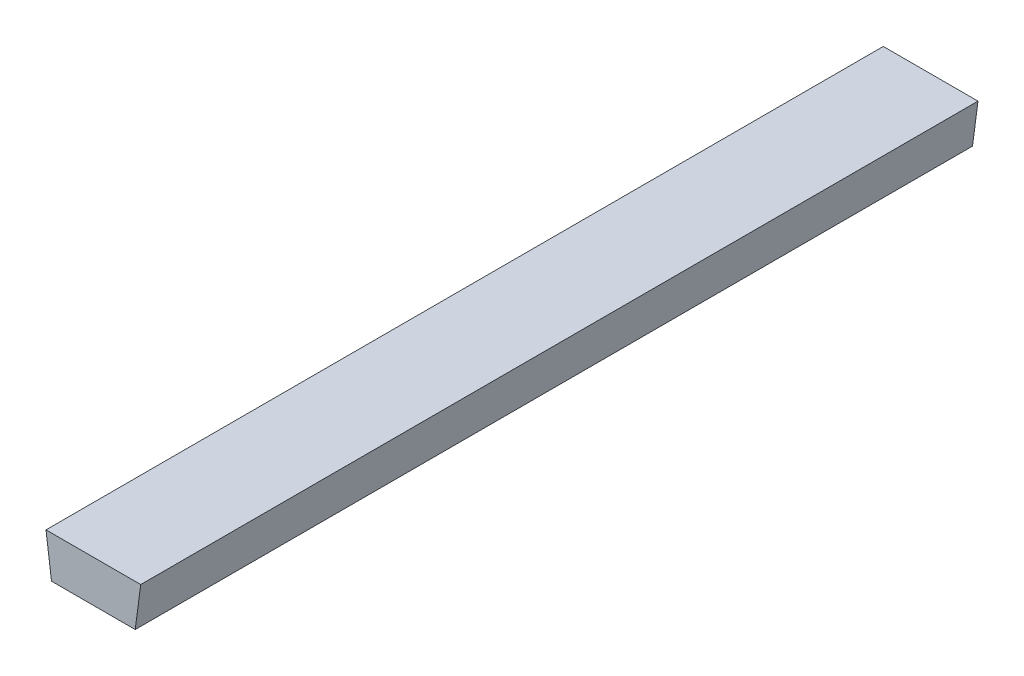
ISO-10303-21;
HEADER;
FILE_DESCRIPTION(('STEP AP214'),'2;1');
FILE_NAME('part.step','',(''),(''),'','','');
FILE_SCHEMA(('AUTOMOTIVE_DESIGN { 1 0 10303 214 1 1 1 1 }'));
ENDSEC;
DATA;
#1=APPLICATION_CONTEXT('core data for automotive mechanical design processes');
#2=APPLICATION_PROTOCOL_DEFINITION('international standard','automotive_design',2000,#1);
#3=PRODUCT_CONTEXT('',#1,'mechanical');
#4=PRODUCT('Part','Part','',(#3));
#5=PRODUCT_RELATED_PRODUCT_CATEGORY('part','',(#4));
#6=PRODUCT_DEFINITION_FORMATION('','',#4);
#7=PRODUCT_DEFINITION_CONTEXT('part definition',#1,'design');
#8=PRODUCT_DEFINITION('design','',#6,#7);
#9=PRODUCT_DEFINITION_SHAPE('','',#8);
#10=(LENGTH_UNIT() NAMED_UNIT(*) SI_UNIT(.MILLI.,.METRE.));
#11=(NAMED_UNIT(*) PLANE_ANGLE_UNIT() SI_UNIT($,.RADIAN.));
#12=(NAMED_UNIT(*) SI_UNIT($,.STERADIAN.) SOLID_ANGLE_UNIT());
#13=UNCERTAINTY_MEASURE_WITH_UNIT(LENGTH_MEASURE(1.E-05),#10,'distance_accuracy_value','');
#14=(GEOMETRIC_REPRESENTATION_CONTEXT(3) GLOBAL_UNCERTAINTY_ASSIGNED_CONTEXT((#13)) GLOBAL_UNIT_ASSIGNED_CONTEXT((#10,
#11,#12)) REPRESENTATION_CONTEXT('',''));
#15=CARTESIAN_POINT('',(0.,0.,0.));
#16=DIRECTION('',(0.,0.,1.));
#17=DIRECTION('',(1.,0.,0.));
#18=AXIS2_PLACEMENT_3D('',#15,#16,#17);
#19=CARTESIAN_POINT('',(20.,0.,400.));
#20=DIRECTION('',(-0.991444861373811,0.130526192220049,0.));
#21=DIRECTION('',(-0.130526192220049,-0.991444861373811,0.));
#22=AXIS2_PLACEMENT_3D('',#19,#20,#21);
#23=PLANE('',#22);
#24=DIRECTION('',(0.130526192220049,0.991444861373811,0.));
#25=VECTOR('',#24,1.);
#26=CARTESIAN_POINT('',(20.,0.,0.));
#27=LINE('',#26,#25);
#28=CARTESIAN_POINT('',(20.,0.,0.));
#29=VERTEX_POINT('',#28);
#30=CARTESIAN_POINT('',(22.6249033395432,19.9381203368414,0.));
#31=VERTEX_POINT('',#30);
#32=EDGE_CURVE('E73',#29,#31,#27,.T.);
#33=ORIENTED_EDGE('',*,*,#32,.T.);
#34=DIRECTION('',(0.,0.,-1.));
#35=VECTOR('',#34,1.);
#36=CARTESIAN_POINT('',(22.6249033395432,19.9381203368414,400.));
#37=LINE('',#36,#35);
#38=CARTESIAN_POINT('',(22.6249033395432,19.9381203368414,400.));
#39=VERTEX_POINT('',#38);
#40=EDGE_CURVE('E11',#39,#31,#37,.T.);
#41=ORIENTED_EDGE('',*,*,#40,.F.);
#42=DIRECTION('',(0.130526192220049,0.991444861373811,0.));
#43=VECTOR('',#42,1.);
#44=CARTESIAN_POINT('',(20.,0.,400.));
#45=LINE('',#44,#43);
#46=CARTESIAN_POINT('',(20.,0.,400.));
#47=VERTEX_POINT('',#46);
#48=EDGE_CURVE('E91',#47,#39,#45,.T.);
#49=ORIENTED_EDGE('',*,*,#48,.F.);
#50=DIRECTION('',(0.,0.,-1.));
#51=VECTOR('',#50,1.);
#52=CARTESIAN_POINT('',(20.,0.,400.));
#53=LINE('',#52,#51);
#54=EDGE_CURVE('E85',#47,#29,#53,.T.);
#55=ORIENTED_EDGE('',*,*,#54,.T.);
#56=EDGE_LOOP('',(#33,#41,#49,#55));
#57=FACE_BOUND('',#56,.T.);
#58=ADVANCED_FACE('F29',(#57),#23,.F.);
#59=CARTESIAN_POINT('',(22.6249033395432,19.9381203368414,400.));
#60=DIRECTION('',(0.,-1.,0.));
#61=DIRECTION('',(1.,0.,0.));
#62=AXIS2_PLACEMENT_3D('',#59,#60,#61);
#63=PLANE('',#62);
#64=DIRECTION('',(-1.,0.,0.));
#65=VECTOR('',#64,1.);
#66=CARTESIAN_POINT('',(22.6249033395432,19.9381203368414,0.));
#67=LINE('',#66,#65);
#68=CARTESIAN_POINT('',(-22.6249033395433,19.9381203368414,0.));
#69=VERTEX_POINT('',#68);
#70=EDGE_CURVE('E69',#31,#69,#67,.T.);
#71=ORIENTED_EDGE('',*,*,#70,.T.);
#72=DIRECTION('',(0.,0.,-1.));
#73=VECTOR('',#72,1.);
#74=CARTESIAN_POINT('',(-22.6249033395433,19.9381203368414,400.));
#75=LINE('',#74,#73);
#76=CARTESIAN_POINT('',(-22.6249033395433,19.9381203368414,400.));
#77=VERTEX_POINT('',#76);
#78=EDGE_CURVE('E36',#77,#69,#75,.T.);
#79=ORIENTED_EDGE('',*,*,#78,.F.);
#80=DIRECTION('',(-1.,0.,0.));
#81=VECTOR('',#80,1.);
#82=CARTESIAN_POINT('',(22.6249033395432,19.9381203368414,400.));
#83=LINE('',#82,#81);
#84=EDGE_CURVE('E81',#39,#77,#83,.T.);
#85=ORIENTED_EDGE('',*,*,#84,.F.);
#86=ORIENTED_EDGE('',*,*,#40,.T.);
#87=EDGE_LOOP('',(#71,#79,#85,#86));
#88=FACE_BOUND('',#87,.T.);
#89=ADVANCED_FACE('F80',(#88),#63,.F.);
#90=CARTESIAN_POINT('',(-20.,0.,400.));
#91=DIRECTION('',(0.99144486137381,0.130526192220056,0.));
#92=DIRECTION('',(-0.130526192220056,0.99144486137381,0.));
#93=AXIS2_PLACEMENT_3D('',#90,#91,#92);
#94=PLANE('',#93);
#95=DIRECTION('',(0.130526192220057,-0.99144486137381,0.));
#96=VECTOR('',#95,1.);
#97=CARTESIAN_POINT('',(-20.,0.,0.));
#98=LINE('',#97,#96);
#99=CARTESIAN_POINT('',(-20.,0.,0.));
#100=VERTEX_POINT('',#99);
#101=EDGE_CURVE('E74',#69,#100,#98,.T.);
#102=ORIENTED_EDGE('',*,*,#101,.T.);
#103=DIRECTION('',(0.,0.,-1.));
#104=VECTOR('',#103,1.);
#105=CARTESIAN_POINT('',(-20.,0.,400.));
#106=LINE('',#105,#104);
#107=CARTESIAN_POINT('',(-20.,0.,400.));
#108=VERTEX_POINT('',#107);
#109=EDGE_CURVE('E97',#108,#100,#106,.T.);
#110=ORIENTED_EDGE('',*,*,#109,.F.);
#111=DIRECTION('',(0.130526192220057,-0.99144486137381,0.));
#112=VECTOR('',#111,1.);
#113=CARTESIAN_POINT('',(-20.,0.,400.));
#114=LINE('',#113,#112);
#115=EDGE_CURVE('E48',#77,#108,#114,.T.);
#116=ORIENTED_EDGE('',*,*,#115,.F.);
#117=ORIENTED_EDGE('',*,*,#78,.T.);
#118=EDGE_LOOP('',(#102,#110,#116,#117));
#119=FACE_BOUND('',#118,.T.);
#120=ADVANCED_FACE('F100',(#119),#94,.F.);
#121=CARTESIAN_POINT('',(-20.,0.,400.));
#122=DIRECTION('',(0.,1.,0.));
#123=DIRECTION('',(0.,0.,1.));
#124=AXIS2_PLACEMENT_3D('',#121,#122,#123);
#125=PLANE('',#124);
#126=DIRECTION('',(1.,0.,0.));
#127=VECTOR('',#126,1.);
#128=CARTESIAN_POINT('',(-20.,0.,0.));
#129=LINE('',#128,#127);
#130=EDGE_CURVE('E89',#100,#29,#129,.T.);
#131=ORIENTED_EDGE('',*,*,#130,.T.);
#132=ORIENTED_EDGE('',*,*,#54,.F.);
#133=DIRECTION('',(1.,0.,0.));
#134=VECTOR('',#133,1.);
#135=CARTESIAN_POINT('',(-20.,0.,400.));
#136=LINE('',#135,#134);
#137=EDGE_CURVE('E43',#108,#47,#136,.T.);
#138=ORIENTED_EDGE('',*,*,#137,.F.);
#139=ORIENTED_EDGE('',*,*,#109,.T.);
#140=EDGE_LOOP('',(#131,#132,#138,#139));
#141=FACE_BOUND('',#140,.T.);
#142=ADVANCED_FACE('F102',(#141),#125,.F.);
#143=CARTESIAN_POINT('',(20.,0.,400.));
#144=DIRECTION('',(0.,0.,-1.));
#145=DIRECTION('',(-1.,0.,0.));
#146=AXIS2_PLACEMENT_3D('',#143,#144,#145);
#147=PLANE('',#146);
#148=ORIENTED_EDGE('',*,*,#48,.T.);
#149=ORIENTED_EDGE('',*,*,#84,.T.);
#150=ORIENTED_EDGE('',*,*,#115,.T.);
#151=ORIENTED_EDGE('',*,*,#137,.T.);
#152=EDGE_LOOP('',(#148,#149,#150,#151));
#153=FACE_BOUND('',#152,.T.);
#154=ADVANCED_FACE('F103',(#153),#147,.F.);
#155=CARTESIAN_POINT('',(20.,0.,0.));
#156=DIRECTION('',(0.,0.,-1.));
#157=DIRECTION('',(-1.,0.,0.));
#158=AXIS2_PLACEMENT_3D('',#155,#156,#157);
#159=PLANE('',#158);
#160=ORIENTED_EDGE('',*,*,#32,.F.);
#161=ORIENTED_EDGE('',*,*,#130,.F.);
#162=ORIENTED_EDGE('',*,*,#101,.F.);
#163=ORIENTED_EDGE('',*,*,#70,.F.);
#164=EDGE_LOOP('',(#160,#161,#162,#163));
#165=FACE_BOUND('',#164,.T.);
#166=ADVANCED_FACE('F70',(#165),#159,.T.);
#167=CLOSED_SHELL('',(#58,#89,#120,#142,#154,#166));
#168=MANIFOLD_SOLID_BREP('B2',#167);
#169=ADVANCED_BREP_SHAPE_REPRESENTATION('',(#18,#168),#14);
#170=SHAPE_DEFINITION_REPRESENTATION(#9,#169);
ENDSEC;
END-ISO-10303-21;
